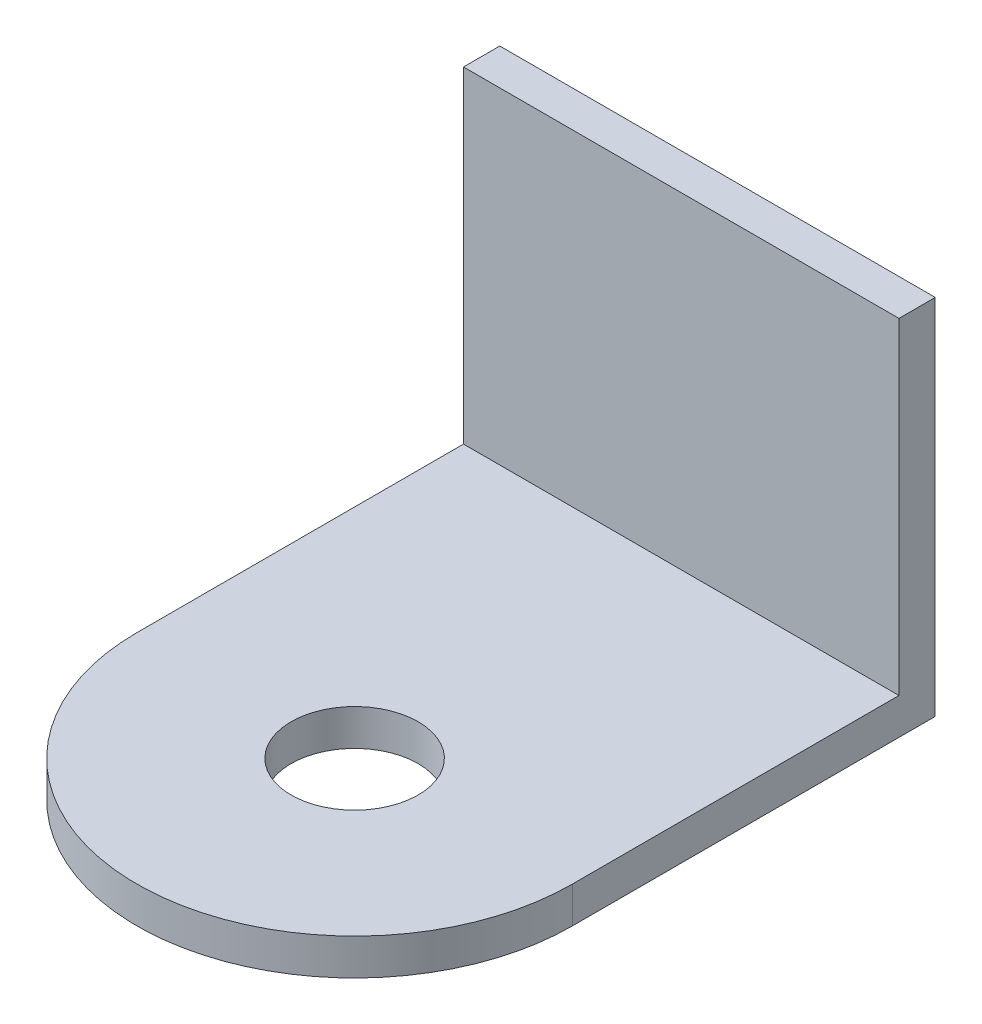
from build123d import *

# Parameters (mm, degrees)
SKETCH1_W      = 12
SKETCH1_H      = 10
EXTRUDE1_DEPTH = 1
SKETCH2_R      = 1.75
EXTRUDE2_DEPTH = 1


with BuildPart() as part:
    # Sketch1 → Extrude1 (new body)
    with BuildSketch(Plane.XY):
        with Locations((6, 5)):
            Rectangle(SKETCH1_W, SKETCH1_H)
    extrude(amount=EXTRUDE1_DEPTH)

    # Sketch2 → Extrude2 (add)
    with BuildSketch(Plane.XZ):
        with BuildLine():
            Line((12, 0), (0, 0))
            Line((0, 0), (0, 10))
            ThreePointArc((0, 10), (5.999999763, 16), (12, 10.000000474))
            Line((12, 10.000000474), (12, 0))
        make_face()
        with Locations(Location((6, 10, 0), (0, 0, 270))):
            Circle(SKETCH2_R, mode=Mode.SUBTRACT)
    extrude(amount=-EXTRUDE2_DEPTH)


solid = part.part
